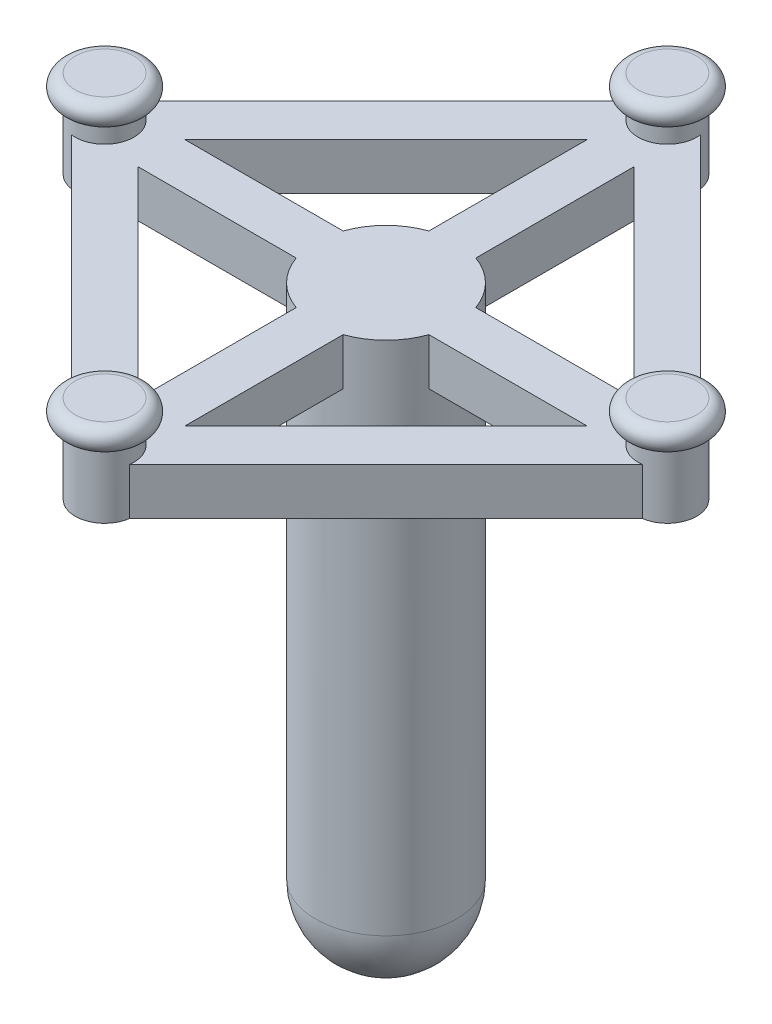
ISO-10303-21;
HEADER;
FILE_DESCRIPTION(('STEP AP214'),'2;1');
FILE_NAME('part.step','',(''),(''),'','','');
FILE_SCHEMA(('AUTOMOTIVE_DESIGN { 1 0 10303 214 1 1 1 1 }'));
ENDSEC;
DATA;
#1=APPLICATION_CONTEXT('core data for automotive mechanical design processes');
#2=APPLICATION_PROTOCOL_DEFINITION('international standard','automotive_design',2000,#1);
#3=PRODUCT_CONTEXT('',#1,'mechanical');
#4=PRODUCT('Part','Part','',(#3));
#5=PRODUCT_RELATED_PRODUCT_CATEGORY('part','',(#4));
#6=PRODUCT_DEFINITION_FORMATION('','',#4);
#7=PRODUCT_DEFINITION_CONTEXT('part definition',#1,'design');
#8=PRODUCT_DEFINITION('design','',#6,#7);
#9=PRODUCT_DEFINITION_SHAPE('','',#8);
#10=(LENGTH_UNIT() NAMED_UNIT(*) SI_UNIT(.MILLI.,.METRE.));
#11=(NAMED_UNIT(*) PLANE_ANGLE_UNIT() SI_UNIT($,.RADIAN.));
#12=(NAMED_UNIT(*) SI_UNIT($,.STERADIAN.) SOLID_ANGLE_UNIT());
#13=UNCERTAINTY_MEASURE_WITH_UNIT(LENGTH_MEASURE(1.E-05),#10,'distance_accuracy_value','');
#14=(GEOMETRIC_REPRESENTATION_CONTEXT(3) GLOBAL_UNCERTAINTY_ASSIGNED_CONTEXT((#13)) GLOBAL_UNIT_ASSIGNED_CONTEXT((#10,
#11,#12)) REPRESENTATION_CONTEXT('',''));
#15=CARTESIAN_POINT('',(0.,0.,0.));
#16=DIRECTION('',(0.,0.,1.));
#17=DIRECTION('',(1.,0.,0.));
#18=AXIS2_PLACEMENT_3D('',#15,#16,#17);
#19=CARTESIAN_POINT('',(-20.1192388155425,2.,9.53345237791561));
#20=DIRECTION('',(0.707106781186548,0.,0.707106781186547));
#21=DIRECTION('',(0.707106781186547,0.,-0.707106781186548));
#22=AXIS2_PLACEMENT_3D('',#19,#20,#21);
#23=PLANE('',#22);
#24=DIRECTION('',(-0.707106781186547,0.,0.707106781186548));
#25=VECTOR('',#24,1.);
#26=CARTESIAN_POINT('',(-20.1192388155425,2.,9.53345237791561));
#27=LINE('',#26,#25);
#28=CARTESIAN_POINT('',(-1.,2.,-9.58578643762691));
#29=VERTEX_POINT('',#28);
#30=CARTESIAN_POINT('',(-9.58578643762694,2.,-0.999999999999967));
#31=VERTEX_POINT('',#30);
#32=EDGE_CURVE('E302',#29,#31,#27,.T.);
#33=ORIENTED_EDGE('',*,*,#32,.T.);
#34=DIRECTION('',(0.,-1.,0.));
#35=VECTOR('',#34,1.);
#36=CARTESIAN_POINT('',(-9.58578643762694,2.,-0.999999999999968));
#37=LINE('',#36,#35);
#38=CARTESIAN_POINT('',(-9.58578643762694,0.,-0.999999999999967));
#39=VERTEX_POINT('',#38);
#40=EDGE_CURVE('E429',#31,#39,#37,.T.);
#41=ORIENTED_EDGE('',*,*,#40,.T.);
#42=DIRECTION('',(-0.707106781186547,0.,0.707106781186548));
#43=VECTOR('',#42,1.);
#44=CARTESIAN_POINT('',(-20.1192388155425,0.,9.53345237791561));
#45=LINE('',#44,#43);
#46=CARTESIAN_POINT('',(-1.,0.,-9.58578643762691));
#47=VERTEX_POINT('',#46);
#48=EDGE_CURVE('E325',#47,#39,#45,.T.);
#49=ORIENTED_EDGE('',*,*,#48,.F.);
#50=DIRECTION('',(0.,1.,0.));
#51=VECTOR('',#50,1.);
#52=CARTESIAN_POINT('',(-1.,2.,-9.58578643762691));
#53=LINE('',#52,#51);
#54=EDGE_CURVE('E229',#47,#29,#53,.T.);
#55=ORIENTED_EDGE('',*,*,#54,.T.);
#56=EDGE_LOOP('',(#33,#41,#49,#55));
#57=FACE_BOUND('',#56,.T.);
#58=ADVANCED_FACE('F36',(#57),#23,.T.);
#59=CARTESIAN_POINT('',(-9.53345237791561,2.,-20.1192388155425));
#60=DIRECTION('',(-0.707106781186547,0.,0.707106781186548));
#61=DIRECTION('',(0.707106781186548,0.,0.707106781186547));
#62=AXIS2_PLACEMENT_3D('',#59,#60,#61);
#63=PLANE('',#62);
#64=DIRECTION('',(-0.707106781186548,0.,-0.707106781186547));
#65=VECTOR('',#64,1.);
#66=CARTESIAN_POINT('',(-9.53345237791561,0.,-20.1192388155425));
#67=LINE('',#66,#65);
#68=CARTESIAN_POINT('',(9.58578643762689,0.,-1.00000000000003));
#69=VERTEX_POINT('',#68);
#70=CARTESIAN_POINT('',(1.,0.,-9.58578643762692));
#71=VERTEX_POINT('',#70);
#72=EDGE_CURVE('E328',#69,#71,#67,.T.);
#73=ORIENTED_EDGE('',*,*,#72,.F.);
#74=DIRECTION('',(0.,1.,0.));
#75=VECTOR('',#74,1.);
#76=CARTESIAN_POINT('',(9.58578643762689,2.,-1.00000000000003));
#77=LINE('',#76,#75);
#78=CARTESIAN_POINT('',(9.58578643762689,2.,-1.00000000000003));
#79=VERTEX_POINT('',#78);
#80=EDGE_CURVE('E421',#69,#79,#77,.T.);
#81=ORIENTED_EDGE('',*,*,#80,.T.);
#82=DIRECTION('',(-0.707106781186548,0.,-0.707106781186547));
#83=VECTOR('',#82,1.);
#84=CARTESIAN_POINT('',(-9.53345237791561,2.,-20.1192388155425));
#85=LINE('',#84,#83);
#86=CARTESIAN_POINT('',(1.,2.,-9.58578643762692));
#87=VERTEX_POINT('',#86);
#88=EDGE_CURVE('E305',#79,#87,#85,.T.);
#89=ORIENTED_EDGE('',*,*,#88,.T.);
#90=DIRECTION('',(0.,-1.,0.));
#91=VECTOR('',#90,1.);
#92=CARTESIAN_POINT('',(1.,2.,-9.58578643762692));
#93=LINE('',#92,#91);
#94=EDGE_CURVE('E224',#87,#71,#93,.T.);
#95=ORIENTED_EDGE('',*,*,#94,.T.);
#96=EDGE_LOOP('',(#73,#81,#89,#95));
#97=FACE_BOUND('',#96,.T.);
#98=ADVANCED_FACE('F371',(#97),#63,.T.);
#99=CARTESIAN_POINT('',(-9.5334523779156,2.,20.1192388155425));
#100=DIRECTION('',(-0.707106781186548,0.,-0.707106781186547));
#101=DIRECTION('',(-0.707106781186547,0.,0.707106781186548));
#102=AXIS2_PLACEMENT_3D('',#99,#100,#101);
#103=PLANE('',#102);
#104=DIRECTION('',(0.707106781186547,0.,-0.707106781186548));
#105=VECTOR('',#104,1.);
#106=CARTESIAN_POINT('',(-9.5334523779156,0.,20.1192388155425));
#107=LINE('',#106,#105);
#108=CARTESIAN_POINT('',(1.,0.,9.58578643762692));
#109=VERTEX_POINT('',#108);
#110=CARTESIAN_POINT('',(9.58578643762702,0.,0.999999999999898));
#111=VERTEX_POINT('',#110);
#112=EDGE_CURVE('E294',#109,#111,#107,.T.);
#113=ORIENTED_EDGE('',*,*,#112,.F.);
#114=DIRECTION('',(0.,1.,0.));
#115=VECTOR('',#114,1.);
#116=CARTESIAN_POINT('',(1.,2.,9.58578643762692));
#117=LINE('',#116,#115);
#118=CARTESIAN_POINT('',(1.,2.,9.58578643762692));
#119=VERTEX_POINT('',#118);
#120=EDGE_CURVE('E391',#109,#119,#117,.T.);
#121=ORIENTED_EDGE('',*,*,#120,.T.);
#122=DIRECTION('',(0.707106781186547,0.,-0.707106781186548));
#123=VECTOR('',#122,1.);
#124=CARTESIAN_POINT('',(-9.5334523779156,2.,20.1192388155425));
#125=LINE('',#124,#123);
#126=CARTESIAN_POINT('',(9.58578643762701,2.,0.9999999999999));
#127=VERTEX_POINT('',#126);
#128=EDGE_CURVE('E295',#119,#127,#125,.T.);
#129=ORIENTED_EDGE('',*,*,#128,.T.);
#130=DIRECTION('',(0.,-1.,0.));
#131=VECTOR('',#130,1.);
#132=CARTESIAN_POINT('',(9.58578643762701,2.,0.9999999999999));
#133=LINE('',#132,#131);
#134=EDGE_CURVE('E393',#127,#111,#133,.T.);
#135=ORIENTED_EDGE('',*,*,#134,.T.);
#136=EDGE_LOOP('',(#113,#121,#129,#135));
#137=FACE_BOUND('',#136,.T.);
#138=ADVANCED_FACE('F377',(#137),#103,.T.);
#139=CARTESIAN_POINT('',(-20.1192388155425,2.,-9.53345237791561));
#140=DIRECTION('',(0.707106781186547,0.,-0.707106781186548));
#141=DIRECTION('',(-0.707106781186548,0.,-0.707106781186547));
#142=AXIS2_PLACEMENT_3D('',#139,#140,#141);
#143=PLANE('',#142);
#144=DIRECTION('',(0.707106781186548,0.,0.707106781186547));
#145=VECTOR('',#144,1.);
#146=CARTESIAN_POINT('',(-20.1192388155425,0.,-9.53345237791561));
#147=LINE('',#146,#145);
#148=CARTESIAN_POINT('',(-9.58578643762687,0.,1.00000000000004));
#149=VERTEX_POINT('',#148);
#150=CARTESIAN_POINT('',(-0.999999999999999,0.,9.5857864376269));
#151=VERTEX_POINT('',#150);
#152=EDGE_CURVE('E322',#149,#151,#147,.T.);
#153=ORIENTED_EDGE('',*,*,#152,.F.);
#154=DIRECTION('',(0.,1.,0.));
#155=VECTOR('',#154,1.);
#156=CARTESIAN_POINT('',(-9.58578643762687,2.,1.00000000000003));
#157=LINE('',#156,#155);
#158=CARTESIAN_POINT('',(-9.58578643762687,2.,1.00000000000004));
#159=VERTEX_POINT('',#158);
#160=EDGE_CURVE('E235',#149,#159,#157,.T.);
#161=ORIENTED_EDGE('',*,*,#160,.T.);
#162=DIRECTION('',(0.707106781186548,0.,0.707106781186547));
#163=VECTOR('',#162,1.);
#164=CARTESIAN_POINT('',(-20.1192388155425,2.,-9.53345237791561));
#165=LINE('',#164,#163);
#166=CARTESIAN_POINT('',(-1.,2.,9.5857864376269));
#167=VERTEX_POINT('',#166);
#168=EDGE_CURVE('E298',#159,#167,#165,.T.);
#169=ORIENTED_EDGE('',*,*,#168,.T.);
#170=DIRECTION('',(0.,-1.,0.));
#171=VECTOR('',#170,1.);
#172=CARTESIAN_POINT('',(-1.,2.,9.5857864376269));
#173=LINE('',#172,#171);
#174=EDGE_CURVE('E433',#167,#151,#173,.T.);
#175=ORIENTED_EDGE('',*,*,#174,.T.);
#176=EDGE_LOOP('',(#153,#161,#169,#175));
#177=FACE_BOUND('',#176,.T.);
#178=ADVANCED_FACE('F382',(#177),#143,.T.);
#179=CARTESIAN_POINT('',(1.,2.,0.));
#180=DIRECTION('',(-1.,0.,0.));
#181=DIRECTION('',(0.,0.,1.));
#182=AXIS2_PLACEMENT_3D('',#179,#180,#181);
#183=PLANE('',#182);
#184=DIRECTION('',(0.,0.,-1.));
#185=VECTOR('',#184,1.);
#186=CARTESIAN_POINT('',(1.,2.,0.));
#187=LINE('',#186,#185);
#188=CARTESIAN_POINT('',(1.,2.,-2.82842712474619));
#189=VERTEX_POINT('',#188);
#190=EDGE_CURVE('E215',#189,#87,#187,.T.);
#191=ORIENTED_EDGE('',*,*,#190,.F.);
#192=DIRECTION('',(0.,-1.,0.));
#193=VECTOR('',#192,1.);
#194=CARTESIAN_POINT('',(1.,2.,-2.82842712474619));
#195=LINE('',#194,#193);
#196=CARTESIAN_POINT('',(1.,0.,-2.82842712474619));
#197=VERTEX_POINT('',#196);
#198=EDGE_CURVE('E198',#189,#197,#195,.T.);
#199=ORIENTED_EDGE('',*,*,#198,.T.);
#200=DIRECTION('',(0.,0.,-1.));
#201=VECTOR('',#200,1.);
#202=CARTESIAN_POINT('',(1.,0.,0.));
#203=LINE('',#202,#201);
#204=EDGE_CURVE('E232',#197,#71,#203,.T.);
#205=ORIENTED_EDGE('',*,*,#204,.T.);
#206=ORIENTED_EDGE('',*,*,#94,.F.);
#207=EDGE_LOOP('',(#191,#199,#205,#206));
#208=FACE_BOUND('',#207,.T.);
#209=ADVANCED_FACE('F222',(#208),#183,.F.);
#210=CARTESIAN_POINT('',(-1.,2.,-11.));
#211=DIRECTION('',(1.,0.,0.));
#212=DIRECTION('',(0.,0.,-1.));
#213=AXIS2_PLACEMENT_3D('',#210,#211,#212);
#214=PLANE('',#213);
#215=DIRECTION('',(0.,0.,1.));
#216=VECTOR('',#215,1.);
#217=CARTESIAN_POINT('',(-1.,0.,-11.));
#218=LINE('',#217,#216);
#219=CARTESIAN_POINT('',(-1.,0.,-2.82842712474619));
#220=VERTEX_POINT('',#219);
#221=EDGE_CURVE('E226',#47,#220,#218,.T.);
#222=ORIENTED_EDGE('',*,*,#221,.T.);
#223=DIRECTION('',(0.,-1.,0.));
#224=VECTOR('',#223,1.);
#225=CARTESIAN_POINT('',(-1.,2.,-2.82842712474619));
#226=LINE('',#225,#224);
#227=CARTESIAN_POINT('',(-1.,2.,-2.82842712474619));
#228=VERTEX_POINT('',#227);
#229=EDGE_CURVE('E208',#220,#228,#226,.F.);
#230=ORIENTED_EDGE('',*,*,#229,.T.);
#231=DIRECTION('',(0.,0.,1.));
#232=VECTOR('',#231,1.);
#233=CARTESIAN_POINT('',(-1.,2.,-11.));
#234=LINE('',#233,#232);
#235=EDGE_CURVE('E225',#29,#228,#234,.T.);
#236=ORIENTED_EDGE('',*,*,#235,.F.);
#237=ORIENTED_EDGE('',*,*,#54,.F.);
#238=EDGE_LOOP('',(#222,#230,#236,#237));
#239=FACE_BOUND('',#238,.T.);
#240=ADVANCED_FACE('F476',(#239),#214,.F.);
#241=CARTESIAN_POINT('',(-8.1192388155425,2.,21.5334523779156));
#242=DIRECTION('',(-0.707106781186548,0.,-0.707106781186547));
#243=DIRECTION('',(-0.707106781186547,0.,0.707106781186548));
#244=AXIS2_PLACEMENT_3D('',#241,#242,#243);
#245=PLANE('',#244);
#246=DIRECTION('',(0.707106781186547,0.,-0.707106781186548));
#247=VECTOR('',#246,1.);
#248=CARTESIAN_POINT('',(-8.1192388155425,0.,21.5334523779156));
#249=LINE('',#248,#247);
#250=CARTESIAN_POINT('',(1.23743686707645,0.,12.1767766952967));
#251=VERTEX_POINT('',#250);
#252=CARTESIAN_POINT('',(12.1767766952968,0.,1.23743686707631));
#253=VERTEX_POINT('',#252);
#254=EDGE_CURVE('E333',#251,#253,#249,.T.);
#255=ORIENTED_EDGE('',*,*,#254,.T.);
#256=DIRECTION('',(0.,1.,0.));
#257=VECTOR('',#256,1.);
#258=CARTESIAN_POINT('',(12.1767766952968,0.,1.23743686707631));
#259=LINE('',#258,#257);
#260=CARTESIAN_POINT('',(12.1767766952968,2.,1.2374368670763));
#261=VERTEX_POINT('',#260);
#262=EDGE_CURVE('E253',#253,#261,#259,.T.);
#263=ORIENTED_EDGE('',*,*,#262,.T.);
#264=DIRECTION('',(0.707106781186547,0.,-0.707106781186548));
#265=VECTOR('',#264,1.);
#266=CARTESIAN_POINT('',(-8.1192388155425,2.,21.5334523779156));
#267=LINE('',#266,#265);
#268=CARTESIAN_POINT('',(1.23743686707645,2.,12.1767766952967));
#269=VERTEX_POINT('',#268);
#270=EDGE_CURVE('E310',#269,#261,#267,.T.);
#271=ORIENTED_EDGE('',*,*,#270,.F.);
#272=DIRECTION('',(0.,1.,0.));
#273=VECTOR('',#272,1.);
#274=CARTESIAN_POINT('',(1.23743686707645,0.,12.1767766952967));
#275=LINE('',#274,#273);
#276=EDGE_CURVE('E265',#269,#251,#275,.F.);
#277=ORIENTED_EDGE('',*,*,#276,.T.);
#278=EDGE_LOOP('',(#255,#263,#271,#277));
#279=FACE_BOUND('',#278,.T.);
#280=ADVANCED_FACE('F509',(#279),#245,.F.);
#281=CARTESIAN_POINT('',(-21.5334523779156,2.,-8.11923881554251));
#282=DIRECTION('',(0.707106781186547,0.,-0.707106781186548));
#283=DIRECTION('',(-0.707106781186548,0.,-0.707106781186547));
#284=AXIS2_PLACEMENT_3D('',#281,#282,#283);
#285=PLANE('',#284);
#286=DIRECTION('',(0.707106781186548,0.,0.707106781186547));
#287=VECTOR('',#286,1.);
#288=CARTESIAN_POINT('',(-21.5334523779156,0.,-8.11923881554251));
#289=LINE('',#288,#287);
#290=CARTESIAN_POINT('',(-12.1767766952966,0.,1.2374368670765));
#291=VERTEX_POINT('',#290);
#292=CARTESIAN_POINT('',(-1.23743686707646,0.,12.1767766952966));
#293=VERTEX_POINT('',#292);
#294=EDGE_CURVE('E331',#291,#293,#289,.T.);
#295=ORIENTED_EDGE('',*,*,#294,.T.);
#296=DIRECTION('',(0.,1.,0.));
#297=VECTOR('',#296,1.);
#298=CARTESIAN_POINT('',(-1.23743686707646,0.,12.1767766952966));
#299=LINE('',#298,#297);
#300=CARTESIAN_POINT('',(-1.23743686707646,2.,12.1767766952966));
#301=VERTEX_POINT('',#300);
#302=EDGE_CURVE('E268',#293,#301,#299,.T.);
#303=ORIENTED_EDGE('',*,*,#302,.T.);
#304=DIRECTION('',(0.707106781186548,0.,0.707106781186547));
#305=VECTOR('',#304,1.);
#306=CARTESIAN_POINT('',(-21.5334523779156,2.,-8.11923881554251));
#307=LINE('',#306,#305);
#308=CARTESIAN_POINT('',(-12.1767766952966,2.,1.2374368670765));
#309=VERTEX_POINT('',#308);
#310=EDGE_CURVE('E307',#309,#301,#307,.T.);
#311=ORIENTED_EDGE('',*,*,#310,.F.);
#312=DIRECTION('',(0.,1.,0.));
#313=VECTOR('',#312,1.);
#314=CARTESIAN_POINT('',(-12.1767766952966,0.,1.2374368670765));
#315=LINE('',#314,#313);
#316=EDGE_CURVE('E279',#309,#291,#315,.F.);
#317=ORIENTED_EDGE('',*,*,#316,.T.);
#318=EDGE_LOOP('',(#295,#303,#311,#317));
#319=FACE_BOUND('',#318,.T.);
#320=ADVANCED_FACE('F575',(#319),#285,.F.);
#321=CARTESIAN_POINT('',(-29.6526911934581,2.,0.));
#322=DIRECTION('',(0.,1.,0.));
#323=DIRECTION('',(0.,0.,1.));
#324=AXIS2_PLACEMENT_3D('',#321,#322,#323);
#325=PLANE('',#324);
#326=CARTESIAN_POINT('',(0.,2.,0.));
#327=DIRECTION('',(0.,-1.,0.));
#328=DIRECTION('',(0.,0.,-1.));
#329=AXIS2_PLACEMENT_3D('',#326,#327,#328);
#330=CIRCLE('',#329,3.);
#331=CARTESIAN_POINT('',(2.82842712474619,2.,-1.00000000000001));
#332=VERTEX_POINT('',#331);
#333=EDGE_CURVE('E201',#189,#332,#330,.T.);
#334=ORIENTED_EDGE('',*,*,#333,.F.);
#335=ORIENTED_EDGE('',*,*,#190,.T.);
#336=ORIENTED_EDGE('',*,*,#88,.F.);
#337=DIRECTION('',(-1.,0.,0.));
#338=VECTOR('',#337,1.);
#339=CARTESIAN_POINT('',(0.,2.,-1.));
#340=LINE('',#339,#338);
#341=EDGE_CURVE('E217',#79,#332,#340,.T.);
#342=ORIENTED_EDGE('',*,*,#341,.T.);
#343=EDGE_LOOP('',(#334,#335,#336,#342));
#344=FACE_BOUND('',#343,.T.);
#345=ORIENTED_EDGE('',*,*,#235,.T.);
#346=CARTESIAN_POINT('',(-2.82842712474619,2.,-0.99999999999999));
#347=VERTEX_POINT('',#346);
#348=EDGE_CURVE('E220',#347,#228,#330,.T.);
#349=ORIENTED_EDGE('',*,*,#348,.F.);
#350=EDGE_CURVE('E415',#347,#31,#340,.T.);
#351=ORIENTED_EDGE('',*,*,#350,.T.);
#352=ORIENTED_EDGE('',*,*,#32,.F.);
#353=EDGE_LOOP('',(#345,#349,#351,#352));
#354=FACE_BOUND('',#353,.T.);
#355=DIRECTION('',(1.,0.,0.));
#356=VECTOR('',#355,1.);
#357=CARTESIAN_POINT('',(-11.,2.,1.00000000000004));
#358=LINE('',#357,#356);
#359=CARTESIAN_POINT('',(-2.82842712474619,2.,1.00000000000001));
#360=VERTEX_POINT('',#359);
#361=EDGE_CURVE('E418',#159,#360,#358,.T.);
#362=ORIENTED_EDGE('',*,*,#361,.T.);
#363=CARTESIAN_POINT('',(-1.,2.,2.82842712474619));
#364=VERTEX_POINT('',#363);
#365=EDGE_CURVE('E444',#364,#360,#330,.T.);
#366=ORIENTED_EDGE('',*,*,#365,.F.);
#367=DIRECTION('',(0.,0.,1.));
#368=VECTOR('',#367,1.);
#369=CARTESIAN_POINT('',(-1.,2.,0.));
#370=LINE('',#369,#368);
#371=EDGE_CURVE('E406',#364,#167,#370,.T.);
#372=ORIENTED_EDGE('',*,*,#371,.T.);
#373=ORIENTED_EDGE('',*,*,#168,.F.);
#374=EDGE_LOOP('',(#362,#366,#372,#373));
#375=FACE_BOUND('',#374,.T.);
#376=CARTESIAN_POINT('',(2.8284271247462,2.,0.99999999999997));
#377=VERTEX_POINT('',#376);
#378=CARTESIAN_POINT('',(1.,2.,2.82842712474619));
#379=VERTEX_POINT('',#378);
#380=EDGE_CURVE('E52',#377,#379,#330,.T.);
#381=ORIENTED_EDGE('',*,*,#380,.F.);
#382=DIRECTION('',(1.,0.,0.));
#383=VECTOR('',#382,1.);
#384=CARTESIAN_POINT('',(0.,2.,1.));
#385=LINE('',#384,#383);
#386=EDGE_CURVE('E411',#377,#127,#385,.T.);
#387=ORIENTED_EDGE('',*,*,#386,.T.);
#388=ORIENTED_EDGE('',*,*,#128,.F.);
#389=DIRECTION('',(0.,0.,-1.));
#390=VECTOR('',#389,1.);
#391=CARTESIAN_POINT('',(1.,2.,11.));
#392=LINE('',#391,#390);
#393=EDGE_CURVE('E409',#119,#379,#392,.T.);
#394=ORIENTED_EDGE('',*,*,#393,.T.);
#395=EDGE_LOOP('',(#381,#387,#388,#394));
#396=FACE_BOUND('',#395,.T.);
#397=DIRECTION('',(-0.707106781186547,0.,0.707106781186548));
#398=VECTOR('',#397,1.);
#399=CARTESIAN_POINT('',(-21.5334523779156,2.,8.11923881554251));
#400=LINE('',#399,#398);
#401=CARTESIAN_POINT('',(-1.23743686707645,2.,-12.1767766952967));
#402=VERTEX_POINT('',#401);
#403=CARTESIAN_POINT('',(-12.1767766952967,2.,-1.23743686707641));
#404=VERTEX_POINT('',#403);
#405=EDGE_CURVE('E316',#402,#404,#400,.T.);
#406=ORIENTED_EDGE('',*,*,#405,.T.);
#407=CARTESIAN_POINT('',(-12.,2.,0.));
#408=DIRECTION('',(0.,1.,0.));
#409=DIRECTION('',(0.,0.,1.));
#410=AXIS2_PLACEMENT_3D('',#407,#408,#409);
#411=CIRCLE('',#410,1.25);
#412=EDGE_CURVE('E274',#309,#404,#411,.T.);
#413=ORIENTED_EDGE('',*,*,#412,.F.);
#414=ORIENTED_EDGE('',*,*,#310,.T.);
#415=CARTESIAN_POINT('',(0.,2.,12.));
#416=DIRECTION('',(0.,1.,0.));
#417=DIRECTION('',(0.,0.,1.));
#418=AXIS2_PLACEMENT_3D('',#415,#416,#417);
#419=CIRCLE('',#418,1.25);
#420=EDGE_CURVE('E263',#269,#301,#419,.T.);
#421=ORIENTED_EDGE('',*,*,#420,.F.);
#422=ORIENTED_EDGE('',*,*,#270,.T.);
#423=CARTESIAN_POINT('',(12.,2.,-1.23920220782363E-13));
#424=DIRECTION('',(0.,1.,0.));
#425=DIRECTION('',(0.,0.,1.));
#426=AXIS2_PLACEMENT_3D('',#423,#424,#425);
#427=CIRCLE('',#426,1.25);
#428=CARTESIAN_POINT('',(12.1767766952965,2.,-1.23743686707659));
#429=VERTEX_POINT('',#428);
#430=EDGE_CURVE('E254',#429,#261,#427,.T.);
#431=ORIENTED_EDGE('',*,*,#430,.F.);
#432=DIRECTION('',(-0.707106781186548,0.,-0.707106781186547));
#433=VECTOR('',#432,1.);
#434=CARTESIAN_POINT('',(-8.11923881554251,2.,-21.5334523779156));
#435=LINE('',#434,#433);
#436=CARTESIAN_POINT('',(1.23743686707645,2.,-12.1767766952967));
#437=VERTEX_POINT('',#436);
#438=EDGE_CURVE('E313',#429,#437,#435,.T.);
#439=ORIENTED_EDGE('',*,*,#438,.T.);
#440=CARTESIAN_POINT('',(0.,2.,-12.));
#441=DIRECTION('',(0.,1.,0.));
#442=DIRECTION('',(0.,0.,1.));
#443=AXIS2_PLACEMENT_3D('',#440,#441,#442);
#444=CIRCLE('',#443,1.25);
#445=EDGE_CURVE('E287',#402,#437,#444,.T.);
#446=ORIENTED_EDGE('',*,*,#445,.F.);
#447=EDGE_LOOP('',(#406,#413,#414,#421,#422,#431,#439,#446));
#448=FACE_BOUND('',#447,.T.);
#449=ADVANCED_FACE('F212',(#344,#354,#375,#396,#448),#325,.T.);
#450=CARTESIAN_POINT('',(-21.5334523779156,2.,8.11923881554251));
#451=DIRECTION('',(0.707106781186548,0.,0.707106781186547));
#452=DIRECTION('',(0.707106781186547,0.,-0.707106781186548));
#453=AXIS2_PLACEMENT_3D('',#450,#451,#452);
#454=PLANE('',#453);
#455=DIRECTION('',(-0.707106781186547,0.,0.707106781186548));
#456=VECTOR('',#455,1.);
#457=CARTESIAN_POINT('',(-21.5334523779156,0.,8.11923881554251));
#458=LINE('',#457,#456);
#459=CARTESIAN_POINT('',(-1.23743686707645,0.,-12.1767766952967));
#460=VERTEX_POINT('',#459);
#461=CARTESIAN_POINT('',(-12.1767766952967,0.,-1.23743686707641));
#462=VERTEX_POINT('',#461);
#463=EDGE_CURVE('E299',#460,#462,#458,.T.);
#464=ORIENTED_EDGE('',*,*,#463,.T.);
#465=DIRECTION('',(0.,1.,0.));
#466=VECTOR('',#465,1.);
#467=CARTESIAN_POINT('',(-12.1767766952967,0.,-1.23743686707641));
#468=LINE('',#467,#466);
#469=EDGE_CURVE('E276',#462,#404,#468,.T.);
#470=ORIENTED_EDGE('',*,*,#469,.T.);
#471=ORIENTED_EDGE('',*,*,#405,.F.);
#472=DIRECTION('',(0.,1.,0.));
#473=VECTOR('',#472,1.);
#474=CARTESIAN_POINT('',(-1.23743686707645,0.,-12.1767766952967));
#475=LINE('',#474,#473);
#476=EDGE_CURVE('E289',#402,#460,#475,.F.);
#477=ORIENTED_EDGE('',*,*,#476,.T.);
#478=EDGE_LOOP('',(#464,#470,#471,#477));
#479=FACE_BOUND('',#478,.T.);
#480=ADVANCED_FACE('F574',(#479),#454,.F.);
#481=CARTESIAN_POINT('',(-8.11923881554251,2.,-21.5334523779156));
#482=DIRECTION('',(-0.707106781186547,0.,0.707106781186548));
#483=DIRECTION('',(0.707106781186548,0.,0.707106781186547));
#484=AXIS2_PLACEMENT_3D('',#481,#482,#483);
#485=PLANE('',#484);
#486=ORIENTED_EDGE('',*,*,#438,.F.);
#487=DIRECTION('',(0.,1.,0.));
#488=VECTOR('',#487,1.);
#489=CARTESIAN_POINT('',(12.1767766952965,0.,-1.2374368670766));
#490=LINE('',#489,#488);
#491=CARTESIAN_POINT('',(12.1767766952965,0.,-1.2374368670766));
#492=VERTEX_POINT('',#491);
#493=EDGE_CURVE('E256',#429,#492,#490,.F.);
#494=ORIENTED_EDGE('',*,*,#493,.T.);
#495=DIRECTION('',(-0.707106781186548,0.,-0.707106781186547));
#496=VECTOR('',#495,1.);
#497=CARTESIAN_POINT('',(-8.11923881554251,0.,-21.5334523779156));
#498=LINE('',#497,#496);
#499=CARTESIAN_POINT('',(1.23743686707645,0.,-12.1767766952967));
#500=VERTEX_POINT('',#499);
#501=EDGE_CURVE('E335',#492,#500,#498,.T.);
#502=ORIENTED_EDGE('',*,*,#501,.T.);
#503=DIRECTION('',(0.,1.,0.));
#504=VECTOR('',#503,1.);
#505=CARTESIAN_POINT('',(1.23743686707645,0.,-12.1767766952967));
#506=LINE('',#505,#504);
#507=EDGE_CURVE('E291',#500,#437,#506,.T.);
#508=ORIENTED_EDGE('',*,*,#507,.T.);
#509=EDGE_LOOP('',(#486,#494,#502,#508));
#510=FACE_BOUND('',#509,.T.);
#511=ADVANCED_FACE('F593',(#510),#485,.F.);
#512=CARTESIAN_POINT('',(-29.6526911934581,0.,0.));
#513=DIRECTION('',(0.,1.,0.));
#514=DIRECTION('',(0.,0.,1.));
#515=AXIS2_PLACEMENT_3D('',#512,#513,#514);
#516=PLANE('',#515);
#517=DIRECTION('',(1.,0.,0.));
#518=VECTOR('',#517,1.);
#519=CARTESIAN_POINT('',(0.,0.,1.));
#520=LINE('',#519,#518);
#521=CARTESIAN_POINT('',(2.8284271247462,0.,0.99999999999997));
#522=VERTEX_POINT('',#521);
#523=EDGE_CURVE('E59',#522,#111,#520,.T.);
#524=ORIENTED_EDGE('',*,*,#523,.F.);
#525=CARTESIAN_POINT('',(0.,0.,0.));
#526=DIRECTION('',(0.,1.,0.));
#527=DIRECTION('',(0.,0.,1.));
#528=AXIS2_PLACEMENT_3D('',#525,#526,#527);
#529=CIRCLE('',#528,3.);
#530=CARTESIAN_POINT('',(2.82842712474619,0.,-1.00000000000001));
#531=VERTEX_POINT('',#530);
#532=EDGE_CURVE('E218',#522,#531,#529,.T.);
#533=ORIENTED_EDGE('',*,*,#532,.T.);
#534=DIRECTION('',(-1.,0.,0.));
#535=VECTOR('',#534,1.);
#536=CARTESIAN_POINT('',(0.,0.,-1.));
#537=LINE('',#536,#535);
#538=EDGE_CURVE('E424',#69,#531,#537,.T.);
#539=ORIENTED_EDGE('',*,*,#538,.F.);
#540=ORIENTED_EDGE('',*,*,#72,.T.);
#541=ORIENTED_EDGE('',*,*,#204,.F.);
#542=EDGE_CURVE('E204',#197,#220,#529,.T.);
#543=ORIENTED_EDGE('',*,*,#542,.T.);
#544=ORIENTED_EDGE('',*,*,#221,.F.);
#545=ORIENTED_EDGE('',*,*,#48,.T.);
#546=CARTESIAN_POINT('',(-2.82842712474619,0.,-0.99999999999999));
#547=VERTEX_POINT('',#546);
#548=EDGE_CURVE('E422',#547,#39,#537,.T.);
#549=ORIENTED_EDGE('',*,*,#548,.F.);
#550=CARTESIAN_POINT('',(-2.82842712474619,0.,1.00000000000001));
#551=VERTEX_POINT('',#550);
#552=EDGE_CURVE('E451',#547,#551,#529,.T.);
#553=ORIENTED_EDGE('',*,*,#552,.T.);
#554=DIRECTION('',(1.,0.,0.));
#555=VECTOR('',#554,1.);
#556=CARTESIAN_POINT('',(-11.,0.,1.00000000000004));
#557=LINE('',#556,#555);
#558=EDGE_CURVE('E417',#149,#551,#557,.T.);
#559=ORIENTED_EDGE('',*,*,#558,.F.);
#560=ORIENTED_EDGE('',*,*,#152,.T.);
#561=DIRECTION('',(0.,0.,1.));
#562=VECTOR('',#561,1.);
#563=CARTESIAN_POINT('',(-1.,0.,0.));
#564=LINE('',#563,#562);
#565=CARTESIAN_POINT('',(-1.,0.,2.82842712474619));
#566=VERTEX_POINT('',#565);
#567=EDGE_CURVE('E407',#566,#151,#564,.T.);
#568=ORIENTED_EDGE('',*,*,#567,.F.);
#569=CARTESIAN_POINT('',(1.,0.,2.82842712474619));
#570=VERTEX_POINT('',#569);
#571=EDGE_CURVE('E403',#566,#570,#529,.T.);
#572=ORIENTED_EDGE('',*,*,#571,.T.);
#573=DIRECTION('',(0.,0.,-1.));
#574=VECTOR('',#573,1.);
#575=CARTESIAN_POINT('',(1.,0.,11.));
#576=LINE('',#575,#574);
#577=EDGE_CURVE('E401',#109,#570,#576,.T.);
#578=ORIENTED_EDGE('',*,*,#577,.F.);
#579=ORIENTED_EDGE('',*,*,#112,.T.);
#580=EDGE_LOOP('',(#524,#533,#539,#540,#541,#543,#544,#545,#549,#553,#559,#560,#568,#572,#578,#579));
#581=FACE_BOUND('',#580,.T.);
#582=ORIENTED_EDGE('',*,*,#501,.F.);
#583=CARTESIAN_POINT('',(12.,0.,-1.23920220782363E-13));
#584=DIRECTION('',(0.,1.,0.));
#585=DIRECTION('',(-1.,0.,0.));
#586=AXIS2_PLACEMENT_3D('',#583,#584,#585);
#587=CIRCLE('',#586,1.25);
#588=EDGE_CURVE('E251',#253,#492,#587,.T.);
#589=ORIENTED_EDGE('',*,*,#588,.F.);
#590=ORIENTED_EDGE('',*,*,#254,.F.);
#591=CARTESIAN_POINT('',(0.,0.,12.));
#592=DIRECTION('',(0.,1.,0.));
#593=DIRECTION('',(0.,0.,-1.));
#594=AXIS2_PLACEMENT_3D('',#591,#592,#593);
#595=CIRCLE('',#594,1.25);
#596=EDGE_CURVE('E261',#293,#251,#595,.T.);
#597=ORIENTED_EDGE('',*,*,#596,.F.);
#598=ORIENTED_EDGE('',*,*,#294,.F.);
#599=CARTESIAN_POINT('',(-12.,0.,0.));
#600=DIRECTION('',(0.,1.,0.));
#601=DIRECTION('',(1.,0.,0.));
#602=AXIS2_PLACEMENT_3D('',#599,#600,#601);
#603=CIRCLE('',#602,1.25);
#604=EDGE_CURVE('E271',#462,#291,#603,.T.);
#605=ORIENTED_EDGE('',*,*,#604,.F.);
#606=ORIENTED_EDGE('',*,*,#463,.F.);
#607=CARTESIAN_POINT('',(0.,0.,-12.));
#608=DIRECTION('',(0.,1.,0.));
#609=DIRECTION('',(0.,0.,1.));
#610=AXIS2_PLACEMENT_3D('',#607,#608,#609);
#611=CIRCLE('',#610,1.25);
#612=EDGE_CURVE('E284',#500,#460,#611,.T.);
#613=ORIENTED_EDGE('',*,*,#612,.F.);
#614=EDGE_LOOP('',(#582,#589,#590,#597,#598,#605,#606,#613));
#615=FACE_BOUND('',#614,.T.);
#616=ADVANCED_FACE('F396',(#581,#615),#516,.F.);
#617=CARTESIAN_POINT('',(0.,0.,-12.));
#618=DIRECTION('',(0.,1.,0.));
#619=DIRECTION('',(0.,0.,1.));
#620=AXIS2_PLACEMENT_3D('',#617,#618,#619);
#621=CYLINDRICAL_SURFACE('',#620,1.25);
#622=ORIENTED_EDGE('',*,*,#507,.F.);
#623=ORIENTED_EDGE('',*,*,#612,.T.);
#624=ORIENTED_EDGE('',*,*,#476,.F.);
#625=ORIENTED_EDGE('',*,*,#445,.T.);
#626=EDGE_LOOP('',(#622,#623,#624,#625));
#627=FACE_BOUND('',#626,.T.);
#628=CARTESIAN_POINT('',(0.,2.75,-12.));
#629=DIRECTION('',(0.,-1.,0.));
#630=DIRECTION('',(0.,0.,-1.));
#631=AXIS2_PLACEMENT_3D('',#628,#629,#630);
#632=CIRCLE('',#631,1.25);
#633=CARTESIAN_POINT('',(0.,2.75,-13.25));
#634=VERTEX_POINT('',#633);
#635=EDGE_CURVE('E319',#634,#634,#632,.F.);
#636=ORIENTED_EDGE('',*,*,#635,.F.);
#637=EDGE_LOOP('',(#636));
#638=FACE_BOUND('',#637,.T.);
#639=ADVANCED_FACE('F592',(#627,#638),#621,.T.);
#640=CARTESIAN_POINT('',(0.,3.25,-12.));
#641=DIRECTION('',(0.,-1.,0.));
#642=DIRECTION('',(0.,0.,-1.));
#643=AXIS2_PLACEMENT_3D('',#640,#641,#642);
#644=TOROIDAL_SURFACE('',#643,1.25,0.5);
#645=CARTESIAN_POINT('',(0.,3.75,-12.));
#646=DIRECTION('',(0.,-1.,0.));
#647=DIRECTION('',(0.,0.,-1.));
#648=AXIS2_PLACEMENT_3D('',#645,#646,#647);
#649=CIRCLE('',#648,1.25);
#650=CARTESIAN_POINT('',(0.,3.75,-13.25));
#651=VERTEX_POINT('',#650);
#652=EDGE_CURVE('E281',#651,#651,#649,.T.);
#653=ORIENTED_EDGE('',*,*,#652,.T.);
#654=EDGE_LOOP('',(#653));
#655=FACE_BOUND('',#654,.T.);
#656=ORIENTED_EDGE('',*,*,#635,.T.);
#657=EDGE_LOOP('',(#656));
#658=FACE_BOUND('',#657,.T.);
#659=ADVANCED_FACE('F606',(#655,#658),#644,.T.);
#660=CARTESIAN_POINT('',(0.,3.75,-12.));
#661=DIRECTION('',(0.,1.,0.));
#662=DIRECTION('',(0.,0.,1.));
#663=AXIS2_PLACEMENT_3D('',#660,#661,#662);
#664=PLANE('',#663);
#665=ORIENTED_EDGE('',*,*,#652,.F.);
#666=EDGE_LOOP('',(#665));
#667=FACE_BOUND('',#666,.T.);
#668=ADVANCED_FACE('F614',(#667),#664,.T.);
#669=CARTESIAN_POINT('',(-12.,0.,0.));
#670=DIRECTION('',(0.,1.,0.));
#671=DIRECTION('',(0.,0.,1.));
#672=AXIS2_PLACEMENT_3D('',#669,#670,#671);
#673=CYLINDRICAL_SURFACE('',#672,1.25);
#674=ORIENTED_EDGE('',*,*,#469,.F.);
#675=ORIENTED_EDGE('',*,*,#604,.T.);
#676=ORIENTED_EDGE('',*,*,#316,.F.);
#677=ORIENTED_EDGE('',*,*,#412,.T.);
#678=EDGE_LOOP('',(#674,#675,#676,#677));
#679=FACE_BOUND('',#678,.T.);
#680=CARTESIAN_POINT('',(-12.,2.75,0.));
#681=DIRECTION('',(0.,-1.,0.));
#682=DIRECTION('',(0.,0.,-1.));
#683=AXIS2_PLACEMENT_3D('',#680,#681,#682);
#684=CIRCLE('',#683,1.25);
#685=CARTESIAN_POINT('',(-12.,2.75,-1.24999999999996));
#686=VERTEX_POINT('',#685);
#687=EDGE_CURVE('E341',#686,#686,#684,.F.);
#688=ORIENTED_EDGE('',*,*,#687,.F.);
#689=EDGE_LOOP('',(#688));
#690=FACE_BOUND('',#689,.T.);
#691=ADVANCED_FACE('F365',(#679,#690),#673,.T.);
#692=CARTESIAN_POINT('',(0.,0.,12.));
#693=DIRECTION('',(0.,1.,0.));
#694=DIRECTION('',(0.,0.,1.));
#695=AXIS2_PLACEMENT_3D('',#692,#693,#694);
#696=CYLINDRICAL_SURFACE('',#695,1.25);
#697=ORIENTED_EDGE('',*,*,#596,.T.);
#698=ORIENTED_EDGE('',*,*,#276,.F.);
#699=ORIENTED_EDGE('',*,*,#420,.T.);
#700=ORIENTED_EDGE('',*,*,#302,.F.);
#701=EDGE_LOOP('',(#697,#698,#699,#700));
#702=FACE_BOUND('',#701,.T.);
#703=CARTESIAN_POINT('',(0.,2.75,12.));
#704=DIRECTION('',(0.,-1.,0.));
#705=DIRECTION('',(0.,0.,-1.));
#706=AXIS2_PLACEMENT_3D('',#703,#704,#705);
#707=CIRCLE('',#706,1.25);
#708=CARTESIAN_POINT('',(0.,2.75,10.75));
#709=VERTEX_POINT('',#708);
#710=EDGE_CURVE('E344',#709,#709,#707,.F.);
#711=ORIENTED_EDGE('',*,*,#710,.F.);
#712=EDGE_LOOP('',(#711));
#713=FACE_BOUND('',#712,.T.);
#714=ADVANCED_FACE('F355',(#702,#713),#696,.T.);
#715=CARTESIAN_POINT('',(12.,0.,-1.23920220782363E-13));
#716=DIRECTION('',(0.,1.,0.));
#717=DIRECTION('',(0.,0.,1.));
#718=AXIS2_PLACEMENT_3D('',#715,#716,#717);
#719=CYLINDRICAL_SURFACE('',#718,1.25);
#720=ORIENTED_EDGE('',*,*,#588,.T.);
#721=ORIENTED_EDGE('',*,*,#493,.F.);
#722=ORIENTED_EDGE('',*,*,#430,.T.);
#723=ORIENTED_EDGE('',*,*,#262,.F.);
#724=EDGE_LOOP('',(#720,#721,#722,#723));
#725=FACE_BOUND('',#724,.T.);
#726=CARTESIAN_POINT('',(12.,2.75,-1.23920220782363E-13));
#727=DIRECTION('',(0.,-1.,0.));
#728=DIRECTION('',(0.,0.,-1.));
#729=AXIS2_PLACEMENT_3D('',#726,#727,#728);
#730=CIRCLE('',#729,1.25);
#731=CARTESIAN_POINT('',(12.,2.75,-1.25000000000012));
#732=VERTEX_POINT('',#731);
#733=EDGE_CURVE('E45',#732,#732,#730,.F.);
#734=ORIENTED_EDGE('',*,*,#733,.F.);
#735=EDGE_LOOP('',(#734));
#736=FACE_BOUND('',#735,.T.);
#737=ADVANCED_FACE('F352',(#725,#736),#719,.T.);
#738=CARTESIAN_POINT('',(-12.,3.25,0.));
#739=DIRECTION('',(0.,-1.,0.));
#740=DIRECTION('',(-1.,0.,0.));
#741=AXIS2_PLACEMENT_3D('',#738,#739,#740);
#742=TOROIDAL_SURFACE('',#741,1.25,0.5);
#743=CARTESIAN_POINT('',(-12.,3.75,0.));
#744=DIRECTION('',(0.,-1.,0.));
#745=DIRECTION('',(-1.,0.,0.));
#746=AXIS2_PLACEMENT_3D('',#743,#744,#745);
#747=CIRCLE('',#746,1.25);
#748=CARTESIAN_POINT('',(-13.25,3.75,0.));
#749=VERTEX_POINT('',#748);
#750=EDGE_CURVE('E248',#749,#749,#747,.T.);
#751=ORIENTED_EDGE('',*,*,#750,.T.);
#752=EDGE_LOOP('',(#751));
#753=FACE_BOUND('',#752,.T.);
#754=ORIENTED_EDGE('',*,*,#687,.T.);
#755=EDGE_LOOP('',(#754));
#756=FACE_BOUND('',#755,.T.);
#757=ADVANCED_FACE('F354',(#753,#756),#742,.T.);
#758=CARTESIAN_POINT('',(-12.,3.75,0.));
#759=DIRECTION('',(0.,1.,0.));
#760=DIRECTION('',(1.,0.,0.));
#761=AXIS2_PLACEMENT_3D('',#758,#759,#760);
#762=PLANE('',#761);
#763=ORIENTED_EDGE('',*,*,#750,.F.);
#764=EDGE_LOOP('',(#763));
#765=FACE_BOUND('',#764,.T.);
#766=ADVANCED_FACE('F362',(#765),#762,.T.);
#767=CARTESIAN_POINT('',(0.,3.25,12.));
#768=DIRECTION('',(0.,-1.,0.));
#769=DIRECTION('',(0.,0.,1.));
#770=AXIS2_PLACEMENT_3D('',#767,#768,#769);
#771=TOROIDAL_SURFACE('',#770,1.25,0.5);
#772=CARTESIAN_POINT('',(0.,3.75,12.));
#773=DIRECTION('',(0.,-1.,0.));
#774=DIRECTION('',(0.,0.,1.));
#775=AXIS2_PLACEMENT_3D('',#772,#773,#774);
#776=CIRCLE('',#775,1.25);
#777=CARTESIAN_POINT('',(0.,3.75,13.25));
#778=VERTEX_POINT('',#777);
#779=EDGE_CURVE('E245',#778,#778,#776,.T.);
#780=ORIENTED_EDGE('',*,*,#779,.T.);
#781=EDGE_LOOP('',(#780));
#782=FACE_BOUND('',#781,.T.);
#783=ORIENTED_EDGE('',*,*,#710,.T.);
#784=EDGE_LOOP('',(#783));
#785=FACE_BOUND('',#784,.T.);
#786=ADVANCED_FACE('F516',(#782,#785),#771,.T.);
#787=CARTESIAN_POINT('',(0.,3.75,12.));
#788=DIRECTION('',(0.,1.,0.));
#789=DIRECTION('',(0.,0.,-1.));
#790=AXIS2_PLACEMENT_3D('',#787,#788,#789);
#791=PLANE('',#790);
#792=ORIENTED_EDGE('',*,*,#779,.F.);
#793=EDGE_LOOP('',(#792));
#794=FACE_BOUND('',#793,.T.);
#795=ADVANCED_FACE('F514',(#794),#791,.T.);
#796=CARTESIAN_POINT('',(12.,3.25,-1.23920220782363E-13));
#797=DIRECTION('',(0.,-1.,0.));
#798=DIRECTION('',(1.,0.,0.));
#799=AXIS2_PLACEMENT_3D('',#796,#797,#798);
#800=TOROIDAL_SURFACE('',#799,1.25,0.5);
#801=CARTESIAN_POINT('',(12.,3.75,-1.23920220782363E-13));
#802=DIRECTION('',(0.,-1.,0.));
#803=DIRECTION('',(1.,0.,0.));
#804=AXIS2_PLACEMENT_3D('',#801,#802,#803);
#805=CIRCLE('',#804,1.25);
#806=CARTESIAN_POINT('',(13.25,3.75,-1.37013275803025E-13));
#807=VERTEX_POINT('',#806);
#808=EDGE_CURVE('E242',#807,#807,#805,.T.);
#809=ORIENTED_EDGE('',*,*,#808,.T.);
#810=EDGE_LOOP('',(#809));
#811=FACE_BOUND('',#810,.T.);
#812=ORIENTED_EDGE('',*,*,#733,.T.);
#813=EDGE_LOOP('',(#812));
#814=FACE_BOUND('',#813,.T.);
#815=ADVANCED_FACE('F350',(#811,#814),#800,.T.);
#816=CARTESIAN_POINT('',(12.,3.75,-1.23920220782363E-13));
#817=DIRECTION('',(0.,1.,0.));
#818=DIRECTION('',(-1.,0.,0.));
#819=AXIS2_PLACEMENT_3D('',#816,#817,#818);
#820=PLANE('',#819);
#821=ORIENTED_EDGE('',*,*,#808,.F.);
#822=EDGE_LOOP('',(#821));
#823=FACE_BOUND('',#822,.T.);
#824=ADVANCED_FACE('F505',(#823),#820,.T.);
#825=CARTESIAN_POINT('',(0.,2.,-1.));
#826=DIRECTION('',(0.,0.,1.));
#827=DIRECTION('',(1.,0.,0.));
#828=AXIS2_PLACEMENT_3D('',#825,#826,#827);
#829=PLANE('',#828);
#830=ORIENTED_EDGE('',*,*,#538,.T.);
#831=DIRECTION('',(0.,-1.,0.));
#832=VECTOR('',#831,1.);
#833=CARTESIAN_POINT('',(2.82842712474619,2.,-1.00000000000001));
#834=LINE('',#833,#832);
#835=EDGE_CURVE('E469',#531,#332,#834,.F.);
#836=ORIENTED_EDGE('',*,*,#835,.T.);
#837=ORIENTED_EDGE('',*,*,#341,.F.);
#838=ORIENTED_EDGE('',*,*,#80,.F.);
#839=EDGE_LOOP('',(#830,#836,#837,#838));
#840=FACE_BOUND('',#839,.T.);
#841=ADVANCED_FACE('F502',(#840),#829,.F.);
#842=ORIENTED_EDGE('',*,*,#350,.F.);
#843=DIRECTION('',(0.,-1.,0.));
#844=VECTOR('',#843,1.);
#845=CARTESIAN_POINT('',(-2.82842712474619,2.,-0.99999999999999));
#846=LINE('',#845,#844);
#847=EDGE_CURVE('E456',#347,#547,#846,.T.);
#848=ORIENTED_EDGE('',*,*,#847,.T.);
#849=ORIENTED_EDGE('',*,*,#548,.T.);
#850=ORIENTED_EDGE('',*,*,#40,.F.);
#851=EDGE_LOOP('',(#842,#848,#849,#850));
#852=FACE_BOUND('',#851,.T.);
#853=ADVANCED_FACE('F482',(#852),#829,.F.);
#854=CARTESIAN_POINT('',(-11.,2.,1.00000000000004));
#855=DIRECTION('',(0.,0.,-1.));
#856=DIRECTION('',(-1.,0.,0.));
#857=AXIS2_PLACEMENT_3D('',#854,#855,#856);
#858=PLANE('',#857);
#859=ORIENTED_EDGE('',*,*,#558,.T.);
#860=DIRECTION('',(0.,-1.,0.));
#861=VECTOR('',#860,1.);
#862=CARTESIAN_POINT('',(-2.82842712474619,2.,1.00000000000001));
#863=LINE('',#862,#861);
#864=EDGE_CURVE('E454',#551,#360,#863,.F.);
#865=ORIENTED_EDGE('',*,*,#864,.T.);
#866=ORIENTED_EDGE('',*,*,#361,.F.);
#867=ORIENTED_EDGE('',*,*,#160,.F.);
#868=EDGE_LOOP('',(#859,#865,#866,#867));
#869=FACE_BOUND('',#868,.T.);
#870=ADVANCED_FACE('F453',(#869),#858,.F.);
#871=CARTESIAN_POINT('',(-1.,2.,0.));
#872=DIRECTION('',(1.,0.,0.));
#873=DIRECTION('',(0.,0.,-1.));
#874=AXIS2_PLACEMENT_3D('',#871,#872,#873);
#875=PLANE('',#874);
#876=ORIENTED_EDGE('',*,*,#371,.F.);
#877=DIRECTION('',(0.,-1.,0.));
#878=VECTOR('',#877,1.);
#879=CARTESIAN_POINT('',(-1.,2.,2.82842712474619));
#880=LINE('',#879,#878);
#881=EDGE_CURVE('E448',#364,#566,#880,.T.);
#882=ORIENTED_EDGE('',*,*,#881,.T.);
#883=ORIENTED_EDGE('',*,*,#567,.T.);
#884=ORIENTED_EDGE('',*,*,#174,.F.);
#885=EDGE_LOOP('',(#876,#882,#883,#884));
#886=FACE_BOUND('',#885,.T.);
#887=ADVANCED_FACE('F447',(#886),#875,.F.);
#888=CARTESIAN_POINT('',(1.,2.,11.));
#889=DIRECTION('',(-1.,0.,0.));
#890=DIRECTION('',(0.,0.,1.));
#891=AXIS2_PLACEMENT_3D('',#888,#889,#890);
#892=PLANE('',#891);
#893=ORIENTED_EDGE('',*,*,#577,.T.);
#894=DIRECTION('',(0.,-1.,0.));
#895=VECTOR('',#894,1.);
#896=CARTESIAN_POINT('',(1.,2.,2.82842712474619));
#897=LINE('',#896,#895);
#898=EDGE_CURVE('E468',#570,#379,#897,.F.);
#899=ORIENTED_EDGE('',*,*,#898,.T.);
#900=ORIENTED_EDGE('',*,*,#393,.F.);
#901=ORIENTED_EDGE('',*,*,#120,.F.);
#902=EDGE_LOOP('',(#893,#899,#900,#901));
#903=FACE_BOUND('',#902,.T.);
#904=ADVANCED_FACE('F467',(#903),#892,.F.);
#905=CARTESIAN_POINT('',(0.,2.,1.));
#906=DIRECTION('',(0.,0.,-1.));
#907=DIRECTION('',(-1.,0.,0.));
#908=AXIS2_PLACEMENT_3D('',#905,#906,#907);
#909=PLANE('',#908);
#910=ORIENTED_EDGE('',*,*,#386,.F.);
#911=DIRECTION('',(0.,-1.,0.));
#912=VECTOR('',#911,1.);
#913=CARTESIAN_POINT('',(2.8284271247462,2.,0.99999999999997));
#914=LINE('',#913,#912);
#915=EDGE_CURVE('E11',#377,#522,#914,.T.);
#916=ORIENTED_EDGE('',*,*,#915,.T.);
#917=ORIENTED_EDGE('',*,*,#523,.T.);
#918=ORIENTED_EDGE('',*,*,#134,.F.);
#919=EDGE_LOOP('',(#910,#916,#917,#918));
#920=FACE_BOUND('',#919,.T.);
#921=ADVANCED_FACE('F488',(#920),#909,.F.);
#922=CARTESIAN_POINT('',(0.,2.,0.));
#923=DIRECTION('',(0.,-1.,0.));
#924=DIRECTION('',(0.,0.,-1.));
#925=AXIS2_PLACEMENT_3D('',#922,#923,#924);
#926=CYLINDRICAL_SURFACE('',#925,3.);
#927=CARTESIAN_POINT('',(0.,-20.,0.));
#928=DIRECTION('',(0.,-1.,0.));
#929=DIRECTION('',(0.,0.,-1.));
#930=AXIS2_PLACEMENT_3D('',#927,#928,#929);
#931=CIRCLE('',#930,3.);
#932=CARTESIAN_POINT('',(0.,-20.,-3.));
#933=VERTEX_POINT('',#932);
#934=EDGE_CURVE('E40',#933,#933,#931,.T.);
#935=ORIENTED_EDGE('',*,*,#934,.F.);
#936=EDGE_LOOP('',(#935));
#937=FACE_BOUND('',#936,.T.);
#938=ORIENTED_EDGE('',*,*,#198,.F.);
#939=ORIENTED_EDGE('',*,*,#333,.T.);
#940=ORIENTED_EDGE('',*,*,#835,.F.);
#941=ORIENTED_EDGE('',*,*,#532,.F.);
#942=ORIENTED_EDGE('',*,*,#915,.F.);
#943=ORIENTED_EDGE('',*,*,#380,.T.);
#944=ORIENTED_EDGE('',*,*,#898,.F.);
#945=ORIENTED_EDGE('',*,*,#571,.F.);
#946=ORIENTED_EDGE('',*,*,#881,.F.);
#947=ORIENTED_EDGE('',*,*,#365,.T.);
#948=ORIENTED_EDGE('',*,*,#864,.F.);
#949=ORIENTED_EDGE('',*,*,#552,.F.);
#950=ORIENTED_EDGE('',*,*,#847,.F.);
#951=ORIENTED_EDGE('',*,*,#348,.T.);
#952=ORIENTED_EDGE('',*,*,#229,.F.);
#953=ORIENTED_EDGE('',*,*,#542,.F.);
#954=EDGE_LOOP('',(#938,#939,#940,#941,#942,#943,#944,#945,#946,#947,#948,#949,#950,#951,#952,#953));
#955=FACE_BOUND('',#954,.T.);
#956=ADVANCED_FACE('F200',(#937,#955),#926,.T.);
#957=CARTESIAN_POINT('',(0.,-20.,0.));
#958=DIRECTION('',(0.,0.,1.));
#959=DIRECTION('',(1.,0.,0.));
#960=AXIS2_PLACEMENT_3D('',#957,#958,#959);
#961=SPHERICAL_SURFACE('',#960,3.);
#962=CARTESIAN_POINT('',(0.,-20.,0.));
#963=DIRECTION('',(0.,-1.,0.));
#964=DIRECTION('',(0.,0.,-1.));
#965=AXIS2_PLACEMENT_3D('',#962,#963,#964);
#966=SPHERICAL_SURFACE('',#965,3.);
#967=ORIENTED_EDGE('',*,*,#934,.T.);
#968=EDGE_LOOP('',(#967));
#969=FACE_BOUND('',#968,.T.);
#970=ADVANCED_FACE('F38',(#969),#966,.T.);
#971=CLOSED_SHELL('',(#58,#98,#138,#178,#209,#240,#280,#320,#449,#480,#511,#616,#639,#659,#668,
#691,#714,#737,#757,#766,#786,#795,#815,#824,#841,#853,#870,#887,#904,#921,#956,#970));
#972=MANIFOLD_SOLID_BREP('B2',#971);
#973=ADVANCED_BREP_SHAPE_REPRESENTATION('',(#18,#972),#14);
#974=SHAPE_DEFINITION_REPRESENTATION(#9,#973);
ENDSEC;
END-ISO-10303-21;
